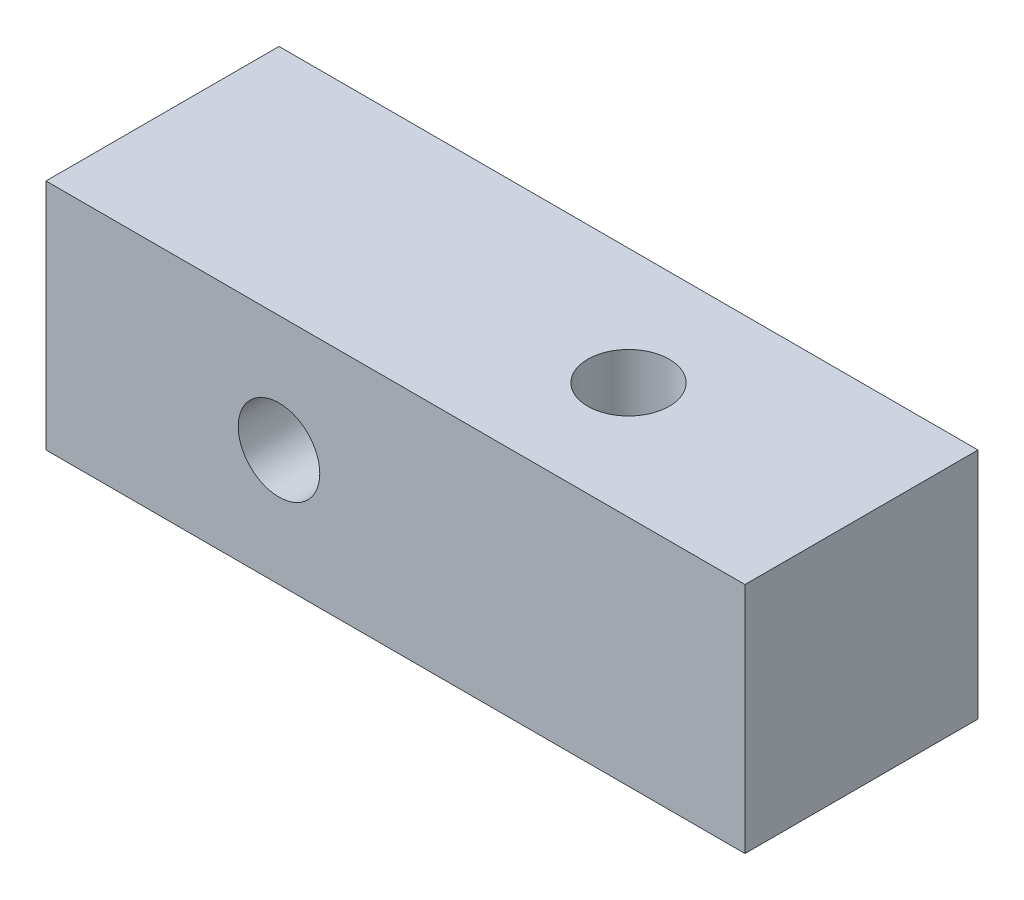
from build123d import *

# Parameters (mm, degrees)
SKICA1_W                 = 30
SKICA1_H                 = 10
SKICA1_R                 = 1.75
P_IDAT_VYSUNUT_M1_DEPTH  = 10
SKICA2_R                 = 1.75
ODEBRAT_VYSUNUT_M1_DEPTH = 46.751885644


with BuildPart() as part:
    # Skica1 → P_idat vysunut_m1 (new body)
    with BuildSketch(Plane.XY):
        with Locations((-28.511320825, -4.888936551)):
            Rectangle(SKICA1_W, SKICA1_H)
        with Locations((-33.511320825, -4.888936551)):
            Circle(SKICA1_R, mode=Mode.SUBTRACT)
    extrude(amount=P_IDAT_VYSUNUT_M1_DEPTH)

    # Skica2 → Odebrat vysunut_m1 (cut, through all)
    with BuildSketch(Plane(origin=(0, 0.111063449, 0), x_dir=(1, 0, 0), z_dir=(0, 1, 0))):
        with Locations(Location((-23.511320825, -5, 0), (0, 0, 180))):
            Circle(SKICA2_R)
    extrude(amount=-ODEBRAT_VYSUNUT_M1_DEPTH, mode=Mode.SUBTRACT)


solid = part.part
